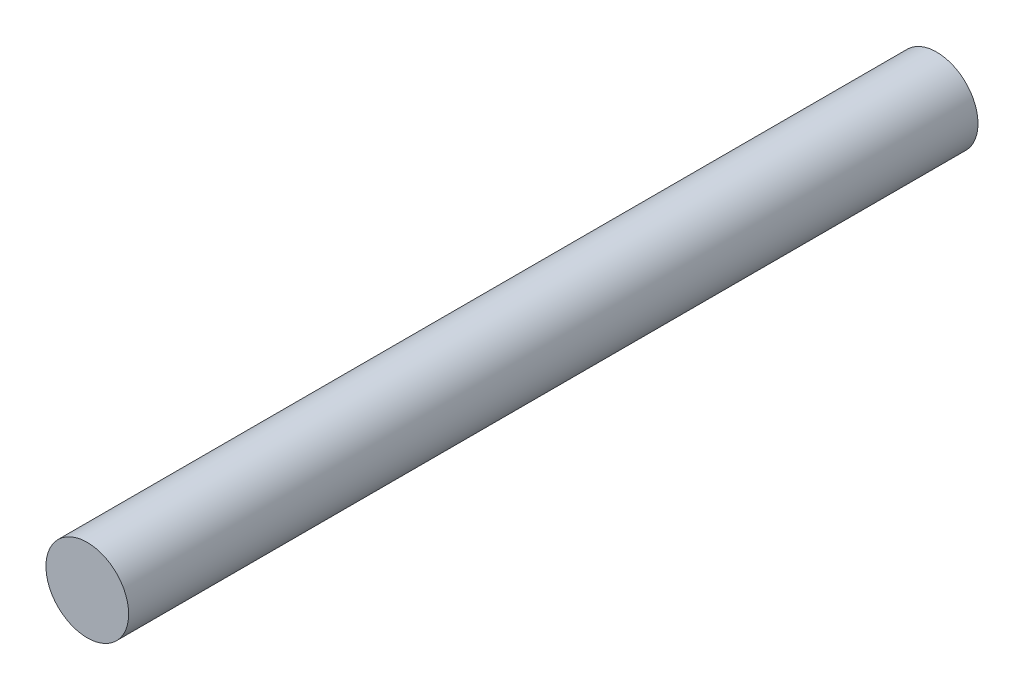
ISO-10303-21;
HEADER;
FILE_DESCRIPTION(('STEP AP214'),'2;1');
FILE_NAME('part.step','',(''),(''),'','','');
FILE_SCHEMA(('AUTOMOTIVE_DESIGN { 1 0 10303 214 1 1 1 1 }'));
ENDSEC;
DATA;
#1=APPLICATION_CONTEXT('core data for automotive mechanical design processes');
#2=APPLICATION_PROTOCOL_DEFINITION('international standard','automotive_design',2000,#1);
#3=PRODUCT_CONTEXT('',#1,'mechanical');
#4=PRODUCT('Part','Part','',(#3));
#5=PRODUCT_RELATED_PRODUCT_CATEGORY('part','',(#4));
#6=PRODUCT_DEFINITION_FORMATION('','',#4);
#7=PRODUCT_DEFINITION_CONTEXT('part definition',#1,'design');
#8=PRODUCT_DEFINITION('design','',#6,#7);
#9=PRODUCT_DEFINITION_SHAPE('','',#8);
#10=(LENGTH_UNIT() NAMED_UNIT(*) SI_UNIT(.MILLI.,.METRE.));
#11=(NAMED_UNIT(*) PLANE_ANGLE_UNIT() SI_UNIT($,.RADIAN.));
#12=(NAMED_UNIT(*) SI_UNIT($,.STERADIAN.) SOLID_ANGLE_UNIT());
#13=UNCERTAINTY_MEASURE_WITH_UNIT(LENGTH_MEASURE(1.E-05),#10,'distance_accuracy_value','');
#14=(GEOMETRIC_REPRESENTATION_CONTEXT(3) GLOBAL_UNCERTAINTY_ASSIGNED_CONTEXT((#13)) GLOBAL_UNIT_ASSIGNED_CONTEXT((#10,
#11,#12)) REPRESENTATION_CONTEXT('',''));
#15=CARTESIAN_POINT('',(0.,0.,0.));
#16=DIRECTION('',(0.,0.,1.));
#17=DIRECTION('',(1.,0.,0.));
#18=AXIS2_PLACEMENT_3D('',#15,#16,#17);
#19=CARTESIAN_POINT('',(0.,0.,16.299999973));
#20=DIRECTION('',(0.,0.,-1.));
#21=DIRECTION('',(-1.,0.,0.));
#22=AXIS2_PLACEMENT_3D('',#19,#20,#21);
#23=CYLINDRICAL_SURFACE('',#22,1.5875);
#24=CARTESIAN_POINT('',(0.,0.,16.299999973));
#25=DIRECTION('',(0.,0.,1.));
#26=DIRECTION('',(1.,0.,0.));
#27=AXIS2_PLACEMENT_3D('',#24,#25,#26);
#28=CIRCLE('',#27,1.5875);
#29=CARTESIAN_POINT('',(1.5875,0.,16.299999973));
#30=VERTEX_POINT('',#29);
#31=EDGE_CURVE('E10',#30,#30,#28,.T.);
#32=ORIENTED_EDGE('',*,*,#31,.F.);
#33=EDGE_LOOP('',(#32));
#34=FACE_BOUND('',#33,.T.);
#35=CARTESIAN_POINT('',(0.,0.,-16.299999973));
#36=DIRECTION('',(0.,0.,1.));
#37=DIRECTION('',(1.,0.,0.));
#38=AXIS2_PLACEMENT_3D('',#35,#36,#37);
#39=CIRCLE('',#38,1.5875);
#40=CARTESIAN_POINT('',(1.5875,0.,-16.299999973));
#41=VERTEX_POINT('',#40);
#42=EDGE_CURVE('E34',#41,#41,#39,.T.);
#43=ORIENTED_EDGE('',*,*,#42,.T.);
#44=EDGE_LOOP('',(#43));
#45=FACE_BOUND('',#44,.T.);
#46=ADVANCED_FACE('F31',(#34,#45),#23,.T.);
#47=CARTESIAN_POINT('',(0.,0.,16.299999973));
#48=DIRECTION('',(0.,0.,1.));
#49=DIRECTION('',(1.,0.,0.));
#50=AXIS2_PLACEMENT_3D('',#47,#48,#49);
#51=PLANE('',#50);
#52=ORIENTED_EDGE('',*,*,#31,.T.);
#53=EDGE_LOOP('',(#52));
#54=FACE_BOUND('',#53,.T.);
#55=ADVANCED_FACE('F46',(#54),#51,.T.);
#56=CARTESIAN_POINT('',(0.,0.,-16.299999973));
#57=DIRECTION('',(0.,0.,1.));
#58=DIRECTION('',(1.,0.,0.));
#59=AXIS2_PLACEMENT_3D('',#56,#57,#58);
#60=PLANE('',#59);
#61=ORIENTED_EDGE('',*,*,#42,.F.);
#62=EDGE_LOOP('',(#61));
#63=FACE_BOUND('',#62,.T.);
#64=ADVANCED_FACE('F44',(#63),#60,.F.);
#65=CLOSED_SHELL('',(#46,#55,#64));
#66=MANIFOLD_SOLID_BREP('B2',#65);
#67=ADVANCED_BREP_SHAPE_REPRESENTATION('',(#18,#66),#14);
#68=SHAPE_DEFINITION_REPRESENTATION(#9,#67);
ENDSEC;
END-ISO-10303-21;
